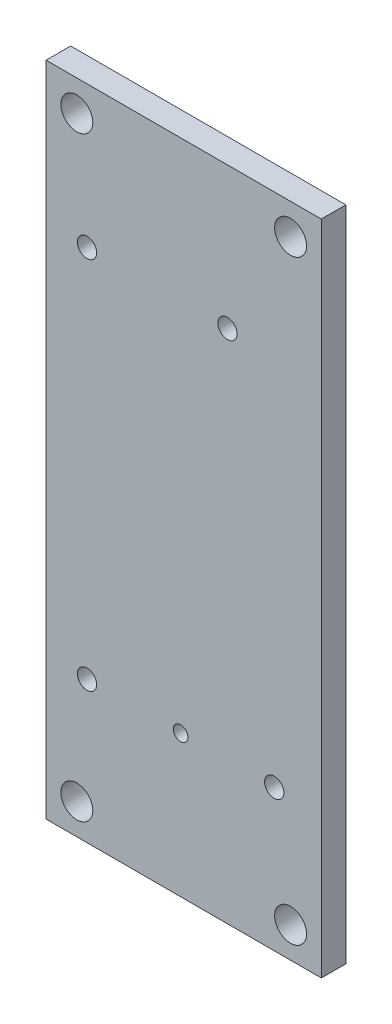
ISO-10303-21;
HEADER;
FILE_DESCRIPTION(('STEP AP214'),'2;1');
FILE_NAME('part.step','',(''),(''),'','','');
FILE_SCHEMA(('AUTOMOTIVE_DESIGN { 1 0 10303 214 1 1 1 1 }'));
ENDSEC;
DATA;
#1=APPLICATION_CONTEXT('core data for automotive mechanical design processes');
#2=APPLICATION_PROTOCOL_DEFINITION('international standard','automotive_design',2000,#1);
#3=PRODUCT_CONTEXT('',#1,'mechanical');
#4=PRODUCT('Part','Part','',(#3));
#5=PRODUCT_RELATED_PRODUCT_CATEGORY('part','',(#4));
#6=PRODUCT_DEFINITION_FORMATION('','',#4);
#7=PRODUCT_DEFINITION_CONTEXT('part definition',#1,'design');
#8=PRODUCT_DEFINITION('design','',#6,#7);
#9=PRODUCT_DEFINITION_SHAPE('','',#8);
#10=(LENGTH_UNIT() NAMED_UNIT(*) SI_UNIT(.MILLI.,.METRE.));
#11=(NAMED_UNIT(*) PLANE_ANGLE_UNIT() SI_UNIT($,.RADIAN.));
#12=(NAMED_UNIT(*) SI_UNIT($,.STERADIAN.) SOLID_ANGLE_UNIT());
#13=UNCERTAINTY_MEASURE_WITH_UNIT(LENGTH_MEASURE(1.E-05),#10,'distance_accuracy_value','');
#14=(GEOMETRIC_REPRESENTATION_CONTEXT(3) GLOBAL_UNCERTAINTY_ASSIGNED_CONTEXT((#13)) GLOBAL_UNIT_ASSIGNED_CONTEXT((#10,
#11,#12)) REPRESENTATION_CONTEXT('',''));
#15=CARTESIAN_POINT('',(0.,0.,0.));
#16=DIRECTION('',(0.,0.,1.));
#17=DIRECTION('',(1.,0.,0.));
#18=AXIS2_PLACEMENT_3D('',#15,#16,#17);
#19=CARTESIAN_POINT('',(0.,0.,11.5624284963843));
#20=DIRECTION('',(0.,0.,1.));
#21=DIRECTION('',(1.,0.,0.));
#22=AXIS2_PLACEMENT_3D('',#19,#20,#21);
#23=PLANE('',#22);
#24=CARTESIAN_POINT('',(-64.3130964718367,35.2468650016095,11.5624284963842));
#25=DIRECTION('',(0.,0.,1.));
#26=DIRECTION('',(1.,0.,0.));
#27=AXIS2_PLACEMENT_3D('',#24,#25,#26);
#28=CIRCLE('',#27,1.3);
#29=CARTESIAN_POINT('',(-63.0130964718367,35.2468650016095,11.5624284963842));
#30=VERTEX_POINT('',#29);
#31=EDGE_CURVE('E159',#30,#30,#28,.T.);
#32=ORIENTED_EDGE('',*,*,#31,.T.);
#33=EDGE_LOOP('',(#32));
#34=FACE_BOUND('',#33,.T.);
#35=CARTESIAN_POINT('',(-46.9130968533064,35.2468650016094,11.5624284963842));
#36=DIRECTION('',(0.,0.,1.));
#37=DIRECTION('',(1.,0.,0.));
#38=AXIS2_PLACEMENT_3D('',#35,#36,#37);
#39=CIRCLE('',#38,1.3);
#40=CARTESIAN_POINT('',(-45.6130968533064,35.2468650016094,11.5624284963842));
#41=VERTEX_POINT('',#40);
#42=EDGE_CURVE('E153',#41,#41,#39,.T.);
#43=ORIENTED_EDGE('',*,*,#42,.T.);
#44=EDGE_LOOP('',(#43));
#45=FACE_BOUND('',#44,.T.);
#46=CARTESIAN_POINT('',(-46.9130968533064,-13.2531349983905,11.5624284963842));
#47=DIRECTION('',(0.,0.,1.));
#48=DIRECTION('',(1.,0.,0.));
#49=AXIS2_PLACEMENT_3D('',#46,#47,#48);
#50=CIRCLE('',#49,1.3);
#51=CARTESIAN_POINT('',(-45.6130968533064,-13.2531349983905,11.5624284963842));
#52=VERTEX_POINT('',#51);
#53=EDGE_CURVE('E147',#52,#52,#50,.T.);
#54=ORIENTED_EDGE('',*,*,#53,.T.);
#55=EDGE_LOOP('',(#54));
#56=FACE_BOUND('',#55,.T.);
#57=CARTESIAN_POINT('',(-64.3130964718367,-13.2531349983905,11.5624284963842));
#58=DIRECTION('',(0.,0.,1.));
#59=DIRECTION('',(1.,0.,0.));
#60=AXIS2_PLACEMENT_3D('',#57,#58,#59);
#61=CIRCLE('',#60,1.3);
#62=CARTESIAN_POINT('',(-63.0130964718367,-13.2531349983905,11.5624284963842));
#63=VERTEX_POINT('',#62);
#64=EDGE_CURVE('E139',#63,#63,#61,.T.);
#65=ORIENTED_EDGE('',*,*,#64,.T.);
#66=EDGE_LOOP('',(#65));
#67=FACE_BOUND('',#66,.T.);
#68=DIRECTION('',(0.,-1.,0.));
#69=VECTOR('',#68,1.);
#70=CARTESIAN_POINT('',(-44.4130968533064,-15.7531349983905,11.5624284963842));
#71=LINE('',#70,#69);
#72=CARTESIAN_POINT('',(-44.4130968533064,37.7468650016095,11.5624284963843));
#73=VERTEX_POINT('',#72);
#74=CARTESIAN_POINT('',(-44.4130968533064,-15.7531349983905,11.5624284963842));
#75=VERTEX_POINT('',#74);
#76=EDGE_CURVE('E85',#73,#75,#71,.T.);
#77=ORIENTED_EDGE('',*,*,#76,.T.);
#78=DIRECTION('',(-1.,0.,0.));
#79=VECTOR('',#78,1.);
#80=CARTESIAN_POINT('',(-44.4130968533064,-15.7531349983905,11.5624284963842));
#81=LINE('',#80,#79);
#82=CARTESIAN_POINT('',(-66.8130964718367,-15.7531349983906,11.5624284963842));
#83=VERTEX_POINT('',#82);
#84=EDGE_CURVE('E80',#75,#83,#81,.T.);
#85=ORIENTED_EDGE('',*,*,#84,.T.);
#86=DIRECTION('',(0.,1.,0.));
#87=VECTOR('',#86,1.);
#88=CARTESIAN_POINT('',(-66.8130964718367,-15.7531349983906,11.5624284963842));
#89=LINE('',#88,#87);
#90=CARTESIAN_POINT('',(-66.8130964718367,37.7468650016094,11.5624284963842));
#91=VERTEX_POINT('',#90);
#92=EDGE_CURVE('E83',#83,#91,#89,.T.);
#93=ORIENTED_EDGE('',*,*,#92,.T.);
#94=DIRECTION('',(1.,0.,0.));
#95=VECTOR('',#94,1.);
#96=CARTESIAN_POINT('',(-44.4130968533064,37.7468650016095,11.5624284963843));
#97=LINE('',#96,#95);
#98=EDGE_CURVE('E50',#91,#73,#97,.T.);
#99=ORIENTED_EDGE('',*,*,#98,.T.);
#100=EDGE_LOOP('',(#77,#85,#93,#99));
#101=FACE_BOUND('',#100,.T.);
#102=CARTESIAN_POINT('',(-52.0556029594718,26.2168662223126,11.5624284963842));
#103=DIRECTION('',(0.,0.,-1.));
#104=DIRECTION('',(-1.,0.,0.));
#105=AXIS2_PLACEMENT_3D('',#102,#103,#104);
#106=CIRCLE('',#105,0.785000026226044);
#107=CARTESIAN_POINT('',(-52.8406029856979,26.2168662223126,11.5624284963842));
#108=VERTEX_POINT('',#107);
#109=EDGE_CURVE('E100',#108,#108,#106,.T.);
#110=ORIENTED_EDGE('',*,*,#109,.F.);
#111=EDGE_LOOP('',(#110));
#112=FACE_BOUND('',#111,.T.);
#113=CARTESIAN_POINT('',(-63.4856032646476,26.2168662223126,11.5624284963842));
#114=DIRECTION('',(0.,0.,-1.));
#115=DIRECTION('',(-1.,0.,0.));
#116=AXIS2_PLACEMENT_3D('',#113,#114,#115);
#117=CIRCLE('',#116,0.785000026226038);
#118=CARTESIAN_POINT('',(-64.2706032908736,26.2168662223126,11.5624284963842));
#119=VERTEX_POINT('',#118);
#120=EDGE_CURVE('E115',#119,#119,#117,.T.);
#121=ORIENTED_EDGE('',*,*,#120,.F.);
#122=EDGE_LOOP('',(#121));
#123=FACE_BOUND('',#122,.T.);
#124=CARTESIAN_POINT('',(-48.2456034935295,-4.22313502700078,11.5624284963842));
#125=DIRECTION('',(0.,0.,-1.));
#126=DIRECTION('',(-1.,0.,0.));
#127=AXIS2_PLACEMENT_3D('',#124,#125,#126);
#128=CIRCLE('',#127,0.785000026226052);
#129=CARTESIAN_POINT('',(-49.0306035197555,-4.22313502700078,11.5624284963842));
#130=VERTEX_POINT('',#129);
#131=EDGE_CURVE('E121',#130,#130,#128,.T.);
#132=ORIENTED_EDGE('',*,*,#131,.F.);
#133=EDGE_LOOP('',(#132));
#134=FACE_BOUND('',#133,.T.);
#135=CARTESIAN_POINT('',(-63.4856032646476,-4.22313502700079,11.5624284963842));
#136=DIRECTION('',(0.,0.,-1.));
#137=DIRECTION('',(-1.,0.,0.));
#138=AXIS2_PLACEMENT_3D('',#135,#136,#137);
#139=CIRCLE('',#138,0.785000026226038);
#140=CARTESIAN_POINT('',(-64.2706032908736,-4.22313502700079,11.5624284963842));
#141=VERTEX_POINT('',#140);
#142=EDGE_CURVE('E127',#141,#141,#139,.T.);
#143=ORIENTED_EDGE('',*,*,#142,.F.);
#144=EDGE_LOOP('',(#143));
#145=FACE_BOUND('',#144,.T.);
#146=CARTESIAN_POINT('',(-55.8656033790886,-4.22313502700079,11.5624284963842));
#147=DIRECTION('',(0.,0.,-1.));
#148=DIRECTION('',(-1.,0.,0.));
#149=AXIS2_PLACEMENT_3D('',#146,#147,#148);
#150=CIRCLE('',#149,0.597890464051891);
#151=CARTESIAN_POINT('',(-56.4634938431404,-4.22313502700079,11.5624284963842));
#152=VERTEX_POINT('',#151);
#153=EDGE_CURVE('E133',#152,#152,#150,.T.);
#154=ORIENTED_EDGE('',*,*,#153,.F.);
#155=EDGE_LOOP('',(#154));
#156=FACE_BOUND('',#155,.T.);
#157=ADVANCED_FACE('F33',(#34,#45,#56,#67,#101,#112,#123,#134,#145,#156),#23,.F.);
#158=CARTESIAN_POINT('',(0.,0.,13.5624284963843));
#159=DIRECTION('',(0.,0.,1.));
#160=DIRECTION('',(1.,0.,0.));
#161=AXIS2_PLACEMENT_3D('',#158,#159,#160);
#162=PLANE('',#161);
#163=CARTESIAN_POINT('',(-64.3130964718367,35.2468650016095,13.5624284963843));
#164=DIRECTION('',(0.,0.,1.));
#165=DIRECTION('',(1.,0.,0.));
#166=AXIS2_PLACEMENT_3D('',#163,#164,#165);
#167=CIRCLE('',#166,1.3);
#168=CARTESIAN_POINT('',(-63.0130964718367,35.2468650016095,13.5624284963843));
#169=VERTEX_POINT('',#168);
#170=EDGE_CURVE('E162',#169,#169,#167,.T.);
#171=ORIENTED_EDGE('',*,*,#170,.F.);
#172=EDGE_LOOP('',(#171));
#173=FACE_BOUND('',#172,.T.);
#174=CARTESIAN_POINT('',(-46.9130968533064,35.2468650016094,13.5624284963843));
#175=DIRECTION('',(0.,0.,1.));
#176=DIRECTION('',(1.,0.,0.));
#177=AXIS2_PLACEMENT_3D('',#174,#175,#176);
#178=CIRCLE('',#177,1.3);
#179=CARTESIAN_POINT('',(-45.6130968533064,35.2468650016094,13.5624284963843));
#180=VERTEX_POINT('',#179);
#181=EDGE_CURVE('E156',#180,#180,#178,.T.);
#182=ORIENTED_EDGE('',*,*,#181,.F.);
#183=EDGE_LOOP('',(#182));
#184=FACE_BOUND('',#183,.T.);
#185=CARTESIAN_POINT('',(-46.9130968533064,-13.2531349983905,13.5624284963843));
#186=DIRECTION('',(0.,0.,1.));
#187=DIRECTION('',(1.,0.,0.));
#188=AXIS2_PLACEMENT_3D('',#185,#186,#187);
#189=CIRCLE('',#188,1.3);
#190=CARTESIAN_POINT('',(-45.6130968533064,-13.2531349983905,13.5624284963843));
#191=VERTEX_POINT('',#190);
#192=EDGE_CURVE('E150',#191,#191,#189,.T.);
#193=ORIENTED_EDGE('',*,*,#192,.F.);
#194=EDGE_LOOP('',(#193));
#195=FACE_BOUND('',#194,.T.);
#196=CARTESIAN_POINT('',(-64.3130964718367,-13.2531349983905,13.5624284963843));
#197=DIRECTION('',(0.,0.,1.));
#198=DIRECTION('',(1.,0.,0.));
#199=AXIS2_PLACEMENT_3D('',#196,#197,#198);
#200=CIRCLE('',#199,1.3);
#201=CARTESIAN_POINT('',(-63.0130964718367,-13.2531349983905,13.5624284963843));
#202=VERTEX_POINT('',#201);
#203=EDGE_CURVE('E144',#202,#202,#200,.T.);
#204=ORIENTED_EDGE('',*,*,#203,.F.);
#205=EDGE_LOOP('',(#204));
#206=FACE_BOUND('',#205,.T.);
#207=CARTESIAN_POINT('',(-63.4856032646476,-4.22313502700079,13.5624284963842));
#208=DIRECTION('',(0.,0.,-1.));
#209=DIRECTION('',(-1.,0.,0.));
#210=AXIS2_PLACEMENT_3D('',#207,#208,#209);
#211=CIRCLE('',#210,0.785000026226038);
#212=CARTESIAN_POINT('',(-64.2706032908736,-4.22313502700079,13.5624284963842));
#213=VERTEX_POINT('',#212);
#214=EDGE_CURVE('E130',#213,#213,#211,.T.);
#215=ORIENTED_EDGE('',*,*,#214,.T.);
#216=EDGE_LOOP('',(#215));
#217=FACE_BOUND('',#216,.T.);
#218=CARTESIAN_POINT('',(-63.4856032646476,26.2168662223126,13.5624284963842));
#219=DIRECTION('',(0.,0.,-1.));
#220=DIRECTION('',(-1.,0.,0.));
#221=AXIS2_PLACEMENT_3D('',#218,#219,#220);
#222=CIRCLE('',#221,0.785000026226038);
#223=CARTESIAN_POINT('',(-64.2706032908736,26.2168662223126,13.5624284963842));
#224=VERTEX_POINT('',#223);
#225=EDGE_CURVE('E118',#224,#224,#222,.T.);
#226=ORIENTED_EDGE('',*,*,#225,.T.);
#227=EDGE_LOOP('',(#226));
#228=FACE_BOUND('',#227,.T.);
#229=DIRECTION('',(0.,-1.,0.));
#230=VECTOR('',#229,1.);
#231=CARTESIAN_POINT('',(-44.4130968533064,-15.7531349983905,13.5624284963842));
#232=LINE('',#231,#230);
#233=CARTESIAN_POINT('',(-44.4130968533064,37.7468650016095,13.5624284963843));
#234=VERTEX_POINT('',#233);
#235=CARTESIAN_POINT('',(-44.4130968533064,-15.7531349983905,13.5624284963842));
#236=VERTEX_POINT('',#235);
#237=EDGE_CURVE('E97',#234,#236,#232,.T.);
#238=ORIENTED_EDGE('',*,*,#237,.F.);
#239=DIRECTION('',(1.,0.,0.));
#240=VECTOR('',#239,1.);
#241=CARTESIAN_POINT('',(-44.4130968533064,37.7468650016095,13.5624284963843));
#242=LINE('',#241,#240);
#243=CARTESIAN_POINT('',(-66.8130964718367,37.7468650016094,13.5624284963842));
#244=VERTEX_POINT('',#243);
#245=EDGE_CURVE('E73',#244,#234,#242,.T.);
#246=ORIENTED_EDGE('',*,*,#245,.F.);
#247=DIRECTION('',(0.,1.,0.));
#248=VECTOR('',#247,1.);
#249=CARTESIAN_POINT('',(-66.8130964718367,-15.7531349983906,13.5624284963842));
#250=LINE('',#249,#248);
#251=CARTESIAN_POINT('',(-66.8130964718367,-15.7531349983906,13.5624284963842));
#252=VERTEX_POINT('',#251);
#253=EDGE_CURVE('E67',#252,#244,#250,.T.);
#254=ORIENTED_EDGE('',*,*,#253,.F.);
#255=DIRECTION('',(-1.,0.,0.));
#256=VECTOR('',#255,1.);
#257=CARTESIAN_POINT('',(-44.4130968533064,-15.7531349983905,13.5624284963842));
#258=LINE('',#257,#256);
#259=EDGE_CURVE('E89',#236,#252,#258,.T.);
#260=ORIENTED_EDGE('',*,*,#259,.F.);
#261=EDGE_LOOP('',(#238,#246,#254,#260));
#262=FACE_BOUND('',#261,.T.);
#263=CARTESIAN_POINT('',(-52.0556029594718,26.2168662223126,13.5624284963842));
#264=DIRECTION('',(0.,0.,-1.));
#265=DIRECTION('',(-1.,0.,0.));
#266=AXIS2_PLACEMENT_3D('',#263,#264,#265);
#267=CIRCLE('',#266,0.785000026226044);
#268=CARTESIAN_POINT('',(-52.8406029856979,26.2168662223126,13.5624284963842));
#269=VERTEX_POINT('',#268);
#270=EDGE_CURVE('E112',#269,#269,#267,.T.);
#271=ORIENTED_EDGE('',*,*,#270,.T.);
#272=EDGE_LOOP('',(#271));
#273=FACE_BOUND('',#272,.T.);
#274=CARTESIAN_POINT('',(-48.2456034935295,-4.22313502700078,13.5624284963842));
#275=DIRECTION('',(0.,0.,-1.));
#276=DIRECTION('',(-1.,0.,0.));
#277=AXIS2_PLACEMENT_3D('',#274,#275,#276);
#278=CIRCLE('',#277,0.785000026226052);
#279=CARTESIAN_POINT('',(-49.0306035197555,-4.22313502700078,13.5624284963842));
#280=VERTEX_POINT('',#279);
#281=EDGE_CURVE('E124',#280,#280,#278,.T.);
#282=ORIENTED_EDGE('',*,*,#281,.T.);
#283=EDGE_LOOP('',(#282));
#284=FACE_BOUND('',#283,.T.);
#285=CARTESIAN_POINT('',(-55.8656033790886,-4.22313502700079,13.5624284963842));
#286=DIRECTION('',(0.,0.,-1.));
#287=DIRECTION('',(-1.,0.,0.));
#288=AXIS2_PLACEMENT_3D('',#285,#286,#287);
#289=CIRCLE('',#288,0.597890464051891);
#290=CARTESIAN_POINT('',(-56.4634938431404,-4.22313502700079,13.5624284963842));
#291=VERTEX_POINT('',#290);
#292=EDGE_CURVE('E136',#291,#291,#289,.T.);
#293=ORIENTED_EDGE('',*,*,#292,.T.);
#294=EDGE_LOOP('',(#293));
#295=FACE_BOUND('',#294,.T.);
#296=ADVANCED_FACE('F108',(#173,#184,#195,#206,#217,#228,#262,#273,#284,#295),#162,.T.);
#297=CARTESIAN_POINT('',(-44.4130968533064,-15.7531349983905,11.5624284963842));
#298=DIRECTION('',(-1.,0.,0.));
#299=DIRECTION('',(0.,-1.,0.));
#300=AXIS2_PLACEMENT_3D('',#297,#298,#299);
#301=PLANE('',#300);
#302=ORIENTED_EDGE('',*,*,#237,.T.);
#303=DIRECTION('',(0.,0.,1.));
#304=VECTOR('',#303,1.);
#305=CARTESIAN_POINT('',(-44.4130968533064,-15.7531349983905,11.5624284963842));
#306=LINE('',#305,#304);
#307=EDGE_CURVE('E11',#75,#236,#306,.T.);
#308=ORIENTED_EDGE('',*,*,#307,.F.);
#309=ORIENTED_EDGE('',*,*,#76,.F.);
#310=DIRECTION('',(0.,0.,1.));
#311=VECTOR('',#310,1.);
#312=CARTESIAN_POINT('',(-44.4130968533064,37.7468650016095,11.5624284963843));
#313=LINE('',#312,#311);
#314=EDGE_CURVE('E93',#73,#234,#313,.T.);
#315=ORIENTED_EDGE('',*,*,#314,.T.);
#316=EDGE_LOOP('',(#302,#308,#309,#315));
#317=FACE_BOUND('',#316,.T.);
#318=ADVANCED_FACE('F35',(#317),#301,.F.);
#319=CARTESIAN_POINT('',(-44.4130968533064,-15.7531349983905,11.5624284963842));
#320=DIRECTION('',(0.,1.,0.));
#321=DIRECTION('',(-1.,0.,0.));
#322=AXIS2_PLACEMENT_3D('',#319,#320,#321);
#323=PLANE('',#322);
#324=ORIENTED_EDGE('',*,*,#259,.T.);
#325=DIRECTION('',(0.,0.,1.));
#326=VECTOR('',#325,1.);
#327=CARTESIAN_POINT('',(-66.8130964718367,-15.7531349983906,11.5624284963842));
#328=LINE('',#327,#326);
#329=EDGE_CURVE('E42',#83,#252,#328,.T.);
#330=ORIENTED_EDGE('',*,*,#329,.F.);
#331=ORIENTED_EDGE('',*,*,#84,.F.);
#332=ORIENTED_EDGE('',*,*,#307,.T.);
#333=EDGE_LOOP('',(#324,#330,#331,#332));
#334=FACE_BOUND('',#333,.T.);
#335=ADVANCED_FACE('F88',(#334),#323,.F.);
#336=CARTESIAN_POINT('',(-66.8130964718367,-15.7531349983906,11.5624284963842));
#337=DIRECTION('',(1.,0.,0.));
#338=DIRECTION('',(0.,1.,0.));
#339=AXIS2_PLACEMENT_3D('',#336,#337,#338);
#340=PLANE('',#339);
#341=ORIENTED_EDGE('',*,*,#253,.T.);
#342=DIRECTION('',(0.,0.,1.));
#343=VECTOR('',#342,1.);
#344=CARTESIAN_POINT('',(-66.8130964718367,37.7468650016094,11.5624284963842));
#345=LINE('',#344,#343);
#346=EDGE_CURVE('E90',#91,#244,#345,.T.);
#347=ORIENTED_EDGE('',*,*,#346,.F.);
#348=ORIENTED_EDGE('',*,*,#92,.F.);
#349=ORIENTED_EDGE('',*,*,#329,.T.);
#350=EDGE_LOOP('',(#341,#347,#348,#349));
#351=FACE_BOUND('',#350,.T.);
#352=ADVANCED_FACE('F91',(#351),#340,.F.);
#353=CARTESIAN_POINT('',(-44.4130968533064,37.7468650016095,11.5624284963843));
#354=DIRECTION('',(0.,-1.,0.));
#355=DIRECTION('',(1.,0.,0.));
#356=AXIS2_PLACEMENT_3D('',#353,#354,#355);
#357=PLANE('',#356);
#358=ORIENTED_EDGE('',*,*,#245,.T.);
#359=ORIENTED_EDGE('',*,*,#314,.F.);
#360=ORIENTED_EDGE('',*,*,#98,.F.);
#361=ORIENTED_EDGE('',*,*,#346,.T.);
#362=EDGE_LOOP('',(#358,#359,#360,#361));
#363=FACE_BOUND('',#362,.T.);
#364=ADVANCED_FACE('F105',(#363),#357,.F.);
#365=CARTESIAN_POINT('',(-52.0556029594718,26.2168662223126,11.5624284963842));
#366=DIRECTION('',(0.,0.,1.));
#367=DIRECTION('',(1.,0.,0.));
#368=AXIS2_PLACEMENT_3D('',#365,#366,#367);
#369=CYLINDRICAL_SURFACE('',#368,0.785000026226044);
#370=ORIENTED_EDGE('',*,*,#109,.T.);
#371=EDGE_LOOP('',(#370));
#372=FACE_BOUND('',#371,.T.);
#373=ORIENTED_EDGE('',*,*,#270,.F.);
#374=EDGE_LOOP('',(#373));
#375=FACE_BOUND('',#374,.T.);
#376=ADVANCED_FACE('F184',(#372,#375),#369,.F.);
#377=CARTESIAN_POINT('',(-63.4856032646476,26.2168662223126,11.5624284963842));
#378=DIRECTION('',(0.,0.,1.));
#379=DIRECTION('',(1.,0.,0.));
#380=AXIS2_PLACEMENT_3D('',#377,#378,#379);
#381=CYLINDRICAL_SURFACE('',#380,0.785000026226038);
#382=ORIENTED_EDGE('',*,*,#120,.T.);
#383=EDGE_LOOP('',(#382));
#384=FACE_BOUND('',#383,.T.);
#385=ORIENTED_EDGE('',*,*,#225,.F.);
#386=EDGE_LOOP('',(#385));
#387=FACE_BOUND('',#386,.T.);
#388=ADVANCED_FACE('F181',(#384,#387),#381,.F.);
#389=CARTESIAN_POINT('',(-48.2456034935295,-4.22313502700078,11.5624284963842));
#390=DIRECTION('',(0.,0.,1.));
#391=DIRECTION('',(1.,0.,0.));
#392=AXIS2_PLACEMENT_3D('',#389,#390,#391);
#393=CYLINDRICAL_SURFACE('',#392,0.785000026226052);
#394=ORIENTED_EDGE('',*,*,#131,.T.);
#395=EDGE_LOOP('',(#394));
#396=FACE_BOUND('',#395,.T.);
#397=ORIENTED_EDGE('',*,*,#281,.F.);
#398=EDGE_LOOP('',(#397));
#399=FACE_BOUND('',#398,.T.);
#400=ADVANCED_FACE('F183',(#396,#399),#393,.F.);
#401=CARTESIAN_POINT('',(-63.4856032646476,-4.22313502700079,11.5624284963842));
#402=DIRECTION('',(0.,0.,1.));
#403=DIRECTION('',(1.,0.,0.));
#404=AXIS2_PLACEMENT_3D('',#401,#402,#403);
#405=CYLINDRICAL_SURFACE('',#404,0.785000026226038);
#406=ORIENTED_EDGE('',*,*,#142,.T.);
#407=EDGE_LOOP('',(#406));
#408=FACE_BOUND('',#407,.T.);
#409=ORIENTED_EDGE('',*,*,#214,.F.);
#410=EDGE_LOOP('',(#409));
#411=FACE_BOUND('',#410,.T.);
#412=ADVANCED_FACE('F191',(#408,#411),#405,.F.);
#413=CARTESIAN_POINT('',(-55.8656033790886,-4.22313502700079,11.5624284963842));
#414=DIRECTION('',(0.,0.,1.));
#415=DIRECTION('',(1.,0.,0.));
#416=AXIS2_PLACEMENT_3D('',#413,#414,#415);
#417=CYLINDRICAL_SURFACE('',#416,0.597890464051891);
#418=ORIENTED_EDGE('',*,*,#153,.T.);
#419=EDGE_LOOP('',(#418));
#420=FACE_BOUND('',#419,.T.);
#421=ORIENTED_EDGE('',*,*,#292,.F.);
#422=EDGE_LOOP('',(#421));
#423=FACE_BOUND('',#422,.T.);
#424=ADVANCED_FACE('F230',(#420,#423),#417,.F.);
#425=CARTESIAN_POINT('',(-64.3130964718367,-13.2531349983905,13.5624284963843));
#426=DIRECTION('',(0.,0.,1.));
#427=DIRECTION('',(1.,0.,0.));
#428=AXIS2_PLACEMENT_3D('',#425,#426,#427);
#429=CYLINDRICAL_SURFACE('',#428,1.3);
#430=ORIENTED_EDGE('',*,*,#64,.F.);
#431=EDGE_LOOP('',(#430));
#432=FACE_BOUND('',#431,.T.);
#433=ORIENTED_EDGE('',*,*,#203,.T.);
#434=EDGE_LOOP('',(#433));
#435=FACE_BOUND('',#434,.T.);
#436=ADVANCED_FACE('F224',(#432,#435),#429,.F.);
#437=CARTESIAN_POINT('',(-46.9130968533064,-13.2531349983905,13.5624284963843));
#438=DIRECTION('',(0.,0.,1.));
#439=DIRECTION('',(1.,0.,0.));
#440=AXIS2_PLACEMENT_3D('',#437,#438,#439);
#441=CYLINDRICAL_SURFACE('',#440,1.3);
#442=ORIENTED_EDGE('',*,*,#53,.F.);
#443=EDGE_LOOP('',(#442));
#444=FACE_BOUND('',#443,.T.);
#445=ORIENTED_EDGE('',*,*,#192,.T.);
#446=EDGE_LOOP('',(#445));
#447=FACE_BOUND('',#446,.T.);
#448=ADVANCED_FACE('F229',(#444,#447),#441,.F.);
#449=CARTESIAN_POINT('',(-46.9130968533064,35.2468650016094,13.5624284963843));
#450=DIRECTION('',(0.,0.,1.));
#451=DIRECTION('',(1.,0.,0.));
#452=AXIS2_PLACEMENT_3D('',#449,#450,#451);
#453=CYLINDRICAL_SURFACE('',#452,1.3);
#454=ORIENTED_EDGE('',*,*,#42,.F.);
#455=EDGE_LOOP('',(#454));
#456=FACE_BOUND('',#455,.T.);
#457=ORIENTED_EDGE('',*,*,#181,.T.);
#458=EDGE_LOOP('',(#457));
#459=FACE_BOUND('',#458,.T.);
#460=ADVANCED_FACE('F242',(#456,#459),#453,.F.);
#461=CARTESIAN_POINT('',(-64.3130964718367,35.2468650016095,13.5624284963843));
#462=DIRECTION('',(0.,0.,1.));
#463=DIRECTION('',(1.,0.,0.));
#464=AXIS2_PLACEMENT_3D('',#461,#462,#463);
#465=CYLINDRICAL_SURFACE('',#464,1.3);
#466=ORIENTED_EDGE('',*,*,#31,.F.);
#467=EDGE_LOOP('',(#466));
#468=FACE_BOUND('',#467,.T.);
#469=ORIENTED_EDGE('',*,*,#170,.T.);
#470=EDGE_LOOP('',(#469));
#471=FACE_BOUND('',#470,.T.);
#472=ADVANCED_FACE('F166',(#468,#471),#465,.F.);
#473=CLOSED_SHELL('',(#157,#296,#318,#335,#352,#364,#376,#388,#400,#412,#424,#436,#448,#460,#472));
#474=MANIFOLD_SOLID_BREP('B2',#473);
#475=ADVANCED_BREP_SHAPE_REPRESENTATION('',(#18,#474),#14);
#476=SHAPE_DEFINITION_REPRESENTATION(#9,#475);
ENDSEC;
END-ISO-10303-21;
